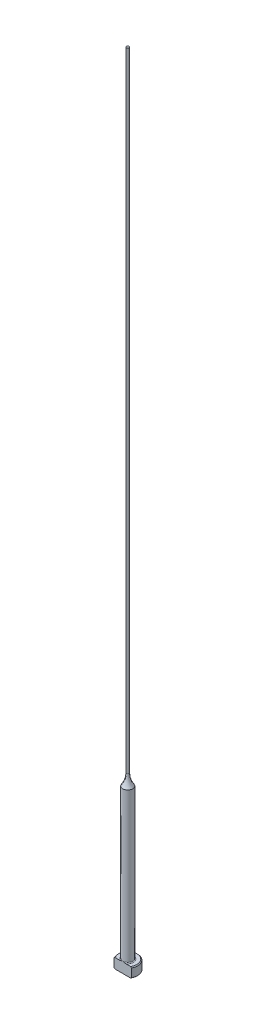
ISO-10303-21;
HEADER;
FILE_DESCRIPTION(('STEP AP214'),'2;1');
FILE_NAME('part.step','',(''),(''),'','','');
FILE_SCHEMA(('AUTOMOTIVE_DESIGN { 1 0 10303 214 1 1 1 1 }'));
ENDSEC;
DATA;
#1=APPLICATION_CONTEXT('core data for automotive mechanical design processes');
#2=APPLICATION_PROTOCOL_DEFINITION('international standard','automotive_design',2000,#1);
#3=PRODUCT_CONTEXT('',#1,'mechanical');
#4=PRODUCT('Part','Part','',(#3));
#5=PRODUCT_RELATED_PRODUCT_CATEGORY('part','',(#4));
#6=PRODUCT_DEFINITION_FORMATION('','',#4);
#7=PRODUCT_DEFINITION_CONTEXT('part definition',#1,'design');
#8=PRODUCT_DEFINITION('design','',#6,#7);
#9=PRODUCT_DEFINITION_SHAPE('','',#8);
#10=(LENGTH_UNIT() NAMED_UNIT(*) SI_UNIT(.MILLI.,.METRE.));
#11=(NAMED_UNIT(*) PLANE_ANGLE_UNIT() SI_UNIT($,.RADIAN.));
#12=(NAMED_UNIT(*) SI_UNIT($,.STERADIAN.) SOLID_ANGLE_UNIT());
#13=UNCERTAINTY_MEASURE_WITH_UNIT(LENGTH_MEASURE(1.E-05),#10,'distance_accuracy_value','');
#14=(GEOMETRIC_REPRESENTATION_CONTEXT(3) GLOBAL_UNCERTAINTY_ASSIGNED_CONTEXT((#13)) GLOBAL_UNIT_ASSIGNED_CONTEXT((#10,
#11,#12)) REPRESENTATION_CONTEXT('',''));
#15=CARTESIAN_POINT('',(0.,0.,0.));
#16=DIRECTION('',(0.,0.,1.));
#17=DIRECTION('',(1.,0.,0.));
#18=AXIS2_PLACEMENT_3D('',#15,#16,#17);
#19=CARTESIAN_POINT('',(-0.396239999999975,254.,0.));
#20=DIRECTION('',(0.,1.,0.));
#21=DIRECTION('',(0.,0.,1.));
#22=AXIS2_PLACEMENT_3D('',#19,#20,#21);
#23=PLANE('',#22);
#24=CARTESIAN_POINT('',(0.,254.,0.));
#25=DIRECTION('',(0.,1.,0.));
#26=DIRECTION('',(0.,0.,1.));
#27=AXIS2_PLACEMENT_3D('',#24,#25,#26);
#28=CIRCLE('',#27,0.396239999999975);
#29=CARTESIAN_POINT('',(0.,254.,0.396239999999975));
#30=VERTEX_POINT('',#29);
#31=EDGE_CURVE('E164',#30,#30,#28,.T.);
#32=ORIENTED_EDGE('',*,*,#31,.T.);
#33=EDGE_LOOP('',(#32));
#34=FACE_BOUND('',#33,.T.);
#35=ADVANCED_FACE('F32',(#34),#23,.T.);
#36=CARTESIAN_POINT('',(0.,259.958771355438,0.));
#37=DIRECTION('',(0.,1.,0.));
#38=DIRECTION('',(0.,0.,1.));
#39=AXIS2_PLACEMENT_3D('',#36,#37,#38);
#40=CYLINDRICAL_SURFACE('',#39,0.396239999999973);
#41=CARTESIAN_POINT('',(0.,54.5026884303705,0.));
#42=DIRECTION('',(0.,1.,0.));
#43=DIRECTION('',(0.,0.,1.));
#44=AXIS2_PLACEMENT_3D('',#41,#42,#43);
#45=CIRCLE('',#44,0.396239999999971);
#46=CARTESIAN_POINT('',(0.,54.5026884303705,0.396239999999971));
#47=VERTEX_POINT('',#46);
#48=EDGE_CURVE('E167',#47,#47,#45,.T.);
#49=ORIENTED_EDGE('',*,*,#48,.T.);
#50=EDGE_LOOP('',(#49));
#51=FACE_BOUND('',#50,.T.);
#52=ORIENTED_EDGE('',*,*,#31,.F.);
#53=EDGE_LOOP('',(#52));
#54=FACE_BOUND('',#53,.T.);
#55=ADVANCED_FACE('F155',(#51,#54),#40,.T.);
#56=CARTESIAN_POINT('',(0.,54.5026884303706,0.));
#57=DIRECTION('',(0.,1.,0.));
#58=DIRECTION('',(0.,0.,1.));
#59=AXIS2_PLACEMENT_3D('',#56,#57,#58);
#60=TOROIDAL_SURFACE('',#59,6.74623999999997,6.35);
#61=CARTESIAN_POINT('',(0.,50.8,0.));
#62=DIRECTION('',(0.,1.,0.));
#63=DIRECTION('',(0.,0.,1.));
#64=AXIS2_PLACEMENT_3D('',#61,#62,#63);
#65=CIRCLE('',#64,1.58749999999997);
#66=CARTESIAN_POINT('',(0.,50.8,1.58749999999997));
#67=VERTEX_POINT('',#66);
#68=EDGE_CURVE('E95',#67,#67,#65,.T.);
#69=ORIENTED_EDGE('',*,*,#68,.T.);
#70=EDGE_LOOP('',(#69));
#71=FACE_BOUND('',#70,.T.);
#72=ORIENTED_EDGE('',*,*,#48,.F.);
#73=EDGE_LOOP('',(#72));
#74=FACE_BOUND('',#73,.T.);
#75=ADVANCED_FACE('F160',(#71,#74),#60,.F.);
#76=CARTESIAN_POINT('',(0.,259.958771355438,0.));
#77=DIRECTION('',(0.,1.,0.));
#78=DIRECTION('',(0.,0.,1.));
#79=AXIS2_PLACEMENT_3D('',#76,#77,#78);
#80=CYLINDRICAL_SURFACE('',#79,1.58749999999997);
#81=CARTESIAN_POINT('',(0.,3.42900000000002,0.));
#82=DIRECTION('',(0.,1.,0.));
#83=DIRECTION('',(0.,0.,1.));
#84=AXIS2_PLACEMENT_3D('',#81,#82,#83);
#85=CIRCLE('',#84,1.58749999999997);
#86=CARTESIAN_POINT('',(0.,3.42900000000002,1.58749999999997));
#87=VERTEX_POINT('',#86);
#88=EDGE_CURVE('E104',#87,#87,#85,.T.);
#89=ORIENTED_EDGE('',*,*,#88,.T.);
#90=EDGE_LOOP('',(#89));
#91=FACE_BOUND('',#90,.T.);
#92=ORIENTED_EDGE('',*,*,#68,.F.);
#93=EDGE_LOOP('',(#92));
#94=FACE_BOUND('',#93,.T.);
#95=ADVANCED_FACE('F187',(#91,#94),#80,.T.);
#96=CARTESIAN_POINT('',(-3.17499999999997,3.175,0.));
#97=DIRECTION('',(0.,1.,0.));
#98=DIRECTION('',(0.,0.,1.));
#99=AXIS2_PLACEMENT_3D('',#96,#97,#98);
#100=PLANE('',#99);
#101=DIRECTION('',(-1.,0.,0.));
#102=VECTOR('',#101,1.);
#103=CARTESIAN_POINT('',(-3.17499999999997,3.175,1.58749999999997));
#104=LINE('',#103,#102);
#105=CARTESIAN_POINT('',(2.45195529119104,3.175,1.58749999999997));
#106=VERTEX_POINT('',#105);
#107=CARTESIAN_POINT('',(0.933255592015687,3.175,1.58749999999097));
#108=VERTEX_POINT('',#107);
#109=EDGE_CURVE('E53',#106,#108,#104,.T.);
#110=ORIENTED_EDGE('',*,*,#109,.F.);
#111=CARTESIAN_POINT('',(0.,3.175,0.));
#112=DIRECTION('',(0.,1.,0.));
#113=DIRECTION('',(0.,0.,1.));
#114=AXIS2_PLACEMENT_3D('',#111,#112,#113);
#115=CIRCLE('',#114,2.92099999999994);
#116=CARTESIAN_POINT('',(-2.45195529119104,3.175,1.58749999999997));
#117=VERTEX_POINT('',#116);
#118=EDGE_CURVE('E166',#106,#117,#115,.T.);
#119=ORIENTED_EDGE('',*,*,#118,.T.);
#120=CARTESIAN_POINT('',(-0.933255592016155,3.17500000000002,1.58749999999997));
#121=VERTEX_POINT('',#120);
#122=EDGE_CURVE('E135',#121,#117,#104,.T.);
#123=ORIENTED_EDGE('',*,*,#122,.F.);
#124=CARTESIAN_POINT('',(0.,3.175,0.));
#125=DIRECTION('',(0.,1.,0.));
#126=DIRECTION('',(0.,0.,1.));
#127=AXIS2_PLACEMENT_3D('',#124,#125,#126);
#128=CIRCLE('',#127,1.84149999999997);
#129=EDGE_CURVE('E108',#121,#108,#128,.F.);
#130=ORIENTED_EDGE('',*,*,#129,.T.);
#131=EDGE_LOOP('',(#110,#119,#123,#130));
#132=FACE_BOUND('',#131,.T.);
#133=ADVANCED_FACE('F184',(#132),#100,.T.);
#134=CARTESIAN_POINT('',(0.,259.958771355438,0.));
#135=DIRECTION('',(0.,1.,0.));
#136=DIRECTION('',(0.,0.,1.));
#137=AXIS2_PLACEMENT_3D('',#134,#135,#136);
#138=CYLINDRICAL_SURFACE('',#137,3.17499999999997);
#139=DIRECTION('',(0.,-1.,0.));
#140=VECTOR('',#139,1.);
#141=CARTESIAN_POINT('',(-2.74963065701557,254.,1.58749999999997));
#142=LINE('',#141,#140);
#143=CARTESIAN_POINT('',(-2.74963065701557,2.92100000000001,1.58749999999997));
#144=VERTEX_POINT('',#143);
#145=CARTESIAN_POINT('',(-2.74963065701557,0.253999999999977,1.58749999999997));
#146=VERTEX_POINT('',#145);
#147=EDGE_CURVE('E90',#144,#146,#142,.T.);
#148=ORIENTED_EDGE('',*,*,#147,.F.);
#149=CARTESIAN_POINT('',(0.,2.92100000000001,0.));
#150=DIRECTION('',(0.,1.,0.));
#151=DIRECTION('',(0.,0.,1.));
#152=AXIS2_PLACEMENT_3D('',#149,#150,#151);
#153=CIRCLE('',#152,3.17499999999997);
#154=CARTESIAN_POINT('',(2.74963065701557,2.92100000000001,1.58749999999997));
#155=VERTEX_POINT('',#154);
#156=EDGE_CURVE('E105',#144,#155,#153,.F.);
#157=ORIENTED_EDGE('',*,*,#156,.T.);
#158=DIRECTION('',(0.,-1.,0.));
#159=VECTOR('',#158,1.);
#160=CARTESIAN_POINT('',(2.74963065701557,254.,1.58749999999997));
#161=LINE('',#160,#159);
#162=CARTESIAN_POINT('',(2.74963065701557,0.253999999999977,1.58749999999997));
#163=VERTEX_POINT('',#162);
#164=EDGE_CURVE('E177',#155,#163,#161,.T.);
#165=ORIENTED_EDGE('',*,*,#164,.T.);
#166=CARTESIAN_POINT('',(0.,0.253999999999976,0.));
#167=DIRECTION('',(0.,-1.,0.));
#168=DIRECTION('',(0.,0.,-1.));
#169=AXIS2_PLACEMENT_3D('',#166,#167,#168);
#170=CIRCLE('',#169,3.17499999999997);
#171=EDGE_CURVE('E111',#163,#146,#170,.F.);
#172=ORIENTED_EDGE('',*,*,#171,.T.);
#173=EDGE_LOOP('',(#148,#157,#165,#172));
#174=FACE_BOUND('',#173,.T.);
#175=ADVANCED_FACE('F175',(#174),#138,.T.);
#176=CARTESIAN_POINT('',(0.,0.,0.));
#177=DIRECTION('',(0.,-1.,0.));
#178=DIRECTION('',(0.,0.,-1.));
#179=AXIS2_PLACEMENT_3D('',#176,#177,#178);
#180=PLANE('',#179);
#181=DIRECTION('',(1.,0.,0.));
#182=VECTOR('',#181,1.);
#183=CARTESIAN_POINT('',(-2.74963065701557,0.,1.58749999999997));
#184=LINE('',#183,#182);
#185=CARTESIAN_POINT('',(-2.45195529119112,0.,1.58749999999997));
#186=VERTEX_POINT('',#185);
#187=CARTESIAN_POINT('',(2.45195529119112,0.,1.58749999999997));
#188=VERTEX_POINT('',#187);
#189=EDGE_CURVE('E87',#186,#188,#184,.T.);
#190=ORIENTED_EDGE('',*,*,#189,.F.);
#191=CARTESIAN_POINT('',(0.,0.,0.));
#192=DIRECTION('',(0.,-1.,0.));
#193=DIRECTION('',(0.,0.,-1.));
#194=AXIS2_PLACEMENT_3D('',#191,#192,#193);
#195=CIRCLE('',#194,2.92100000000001);
#196=EDGE_CURVE('E101',#186,#188,#195,.T.);
#197=ORIENTED_EDGE('',*,*,#196,.T.);
#198=EDGE_LOOP('',(#190,#197));
#199=FACE_BOUND('',#198,.T.);
#200=ADVANCED_FACE('F100',(#199),#180,.T.);
#201=CARTESIAN_POINT('',(0.,3.17499999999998,0.));
#202=DIRECTION('',(0.,-1.,0.));
#203=DIRECTION('',(0.,0.,-1.));
#204=AXIS2_PLACEMENT_3D('',#201,#202,#203);
#205=CONICAL_SURFACE('',#204,2.92099999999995,0.785398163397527);
#206=CARTESIAN_POINT('',(6.0529050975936,-0.16162066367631,1.58749999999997));
#207=CARTESIAN_POINT('',(5.91567682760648,-0.0288893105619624,1.58749999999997));
#208=CARTESIAN_POINT('',(5.7783103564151,0.103699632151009,1.58749999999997));
#209=CARTESIAN_POINT('',(5.50321874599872,0.368508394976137,1.58749999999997));
#210=CARTESIAN_POINT('',(5.36549360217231,0.500728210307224,1.58749999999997));
#211=CARTESIAN_POINT('',(5.08953516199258,0.764778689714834,1.58749999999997));
#212=CARTESIAN_POINT('',(4.9513016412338,0.896609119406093,1.58749999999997));
#213=CARTESIAN_POINT('',(4.67428233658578,1.15968706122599,1.58749999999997));
#214=CARTESIAN_POINT('',(4.53549655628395,1.29093457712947,1.58749999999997));
#215=CARTESIAN_POINT('',(4.25997724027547,1.55007705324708,1.58749999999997));
#216=CARTESIAN_POINT('',(4.12325766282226,1.67798684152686,1.58749999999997));
#217=CARTESIAN_POINT('',(3.84892898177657,1.9328486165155,1.58749999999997));
#218=CARTESIAN_POINT('',(3.71131988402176,2.05980060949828,1.58749999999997));
#219=CARTESIAN_POINT('',(3.43493978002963,2.31237508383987,1.58749999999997));
#220=CARTESIAN_POINT('',(3.29616903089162,2.43799784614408,1.58749999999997));
#221=CARTESIAN_POINT('',(3.01699558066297,2.68741369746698,1.58749999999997));
#222=CARTESIAN_POINT('',(2.8765929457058,2.81120686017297,1.58749999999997));
#223=CARTESIAN_POINT('',(2.64816703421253,3.00875865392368,1.58749999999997));
#224=CARTESIAN_POINT('',(2.56087478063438,3.08336151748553,1.58749999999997));
#225=CARTESIAN_POINT('',(2.38515423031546,3.23123871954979,1.58749999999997));
#226=CARTESIAN_POINT('',(2.29672582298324,3.30451292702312,1.58749999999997));
#227=CARTESIAN_POINT('',(2.11747400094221,3.45004422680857,1.58749999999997));
#228=CARTESIAN_POINT('',(2.02663514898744,3.5222823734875,1.58749999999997));
#229=CARTESIAN_POINT('',(1.8430252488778,3.66423097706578,1.58749999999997));
#230=CARTESIAN_POINT('',(1.75025467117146,3.73394203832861,1.58749999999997));
#231=CARTESIAN_POINT('',(1.56067475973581,3.87080633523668,1.58749999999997));
#232=CARTESIAN_POINT('',(1.46382547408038,3.93790459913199,1.58749999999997));
#233=CARTESIAN_POINT('',(1.26632594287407,4.06669147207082,1.58749999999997));
#234=CARTESIAN_POINT('',(1.16567073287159,4.1283726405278,1.58749999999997));
#235=CARTESIAN_POINT('',(1.01165766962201,4.21402252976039,1.58749999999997));
#236=CARTESIAN_POINT('',(0.960142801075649,4.24127929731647,1.58749999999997));
#237=CARTESIAN_POINT('',(0.855780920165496,4.2930979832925,1.58749999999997));
#238=CARTESIAN_POINT('',(0.80293366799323,4.31765941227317,1.58749999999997));
#239=CARTESIAN_POINT('',(0.642461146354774,4.38614656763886,1.58749999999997));
#240=CARTESIAN_POINT('',(0.532518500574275,4.42510149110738,1.58749999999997));
#241=CARTESIAN_POINT('',(0.367680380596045,4.46726244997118,1.58749999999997));
#242=CARTESIAN_POINT('',(0.31480288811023,4.47844427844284,1.58749999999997));
#243=CARTESIAN_POINT('',(0.208209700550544,4.49576654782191,1.58749999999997));
#244=CARTESIAN_POINT('',(0.154494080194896,4.50190743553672,1.58749999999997));
#245=CARTESIAN_POINT('',(0.0468792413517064,4.50871296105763,1.58749999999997));
#246=CARTESIAN_POINT('',(-0.0070188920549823,4.5093945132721,1.58749999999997));
#247=CARTESIAN_POINT('',(-0.114606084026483,4.50527679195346,1.58749999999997));
#248=CARTESIAN_POINT('',(-0.168295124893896,4.50047706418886,1.58749999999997));
#249=CARTESIAN_POINT('',(-0.274485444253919,4.48579689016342,1.58749999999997));
#250=CARTESIAN_POINT('',(-0.326992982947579,4.47596081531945,1.58749999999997));
#251=CARTESIAN_POINT('',(-0.430974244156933,4.45181809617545,1.58749999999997));
#252=CARTESIAN_POINT('',(-0.482447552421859,4.4375096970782,1.58749999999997));
#253=CARTESIAN_POINT('',(-0.584460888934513,4.40502489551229,1.58749999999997));
#254=CARTESIAN_POINT('',(-0.634994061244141,4.386827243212,1.58749999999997));
#255=CARTESIAN_POINT('',(-0.734789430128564,4.34729308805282,1.58749999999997));
#256=CARTESIAN_POINT('',(-0.784051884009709,4.3259572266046,1.58749999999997));
#257=CARTESIAN_POINT('',(-0.930549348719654,4.25791922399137,1.58749999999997));
#258=CARTESIAN_POINT('',(-1.0259880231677,4.20736047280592,1.58749999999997));
#259=CARTESIAN_POINT('',(-1.21304313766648,4.0995545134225,1.58749999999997));
#260=CARTESIAN_POINT('',(-1.30465471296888,4.04229912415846,1.58749999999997));
#261=CARTESIAN_POINT('',(-1.48526211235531,3.92308746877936,1.58749999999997));
#262=CARTESIAN_POINT('',(-1.57424615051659,3.86111349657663,1.58749999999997));
#263=CARTESIAN_POINT('',(-1.74990003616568,3.73408621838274,1.58749999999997));
#264=CARTESIAN_POINT('',(-1.83657099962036,3.66903444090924,1.58749999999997));
#265=CARTESIAN_POINT('',(-2.00931764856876,3.53583371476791,1.58749999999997));
#266=CARTESIAN_POINT('',(-2.09537048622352,3.46765527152,1.58749999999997));
#267=CARTESIAN_POINT('',(-2.26611736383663,3.32960643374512,1.58749999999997));
#268=CARTESIAN_POINT('',(-2.35081125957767,3.25973586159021,1.58749999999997));
#269=CARTESIAN_POINT('',(-2.60290121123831,3.04858139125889,1.58749999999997));
#270=CARTESIAN_POINT('',(-2.76872537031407,2.90542388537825,1.58749999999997));
#271=CARTESIAN_POINT('',(-3.06970913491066,2.64069522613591,1.58749999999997));
#272=CARTESIAN_POINT('',(-3.20528660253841,2.51959458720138,1.58749999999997));
#273=CARTESIAN_POINT('',(-3.47510321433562,2.27590400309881,1.58749999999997));
#274=CARTESIAN_POINT('',(-3.60934232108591,2.1533140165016,1.58749999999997));
#275=CARTESIAN_POINT('',(-3.87695374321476,1.90694239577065,1.58749999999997));
#276=CARTESIAN_POINT('',(-4.0103251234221,1.78315974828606,1.58749999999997));
#277=CARTESIAN_POINT('',(-4.27630880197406,1.53478104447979,1.58749999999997));
#278=CARTESIAN_POINT('',(-4.40892109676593,1.41018498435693,1.58749999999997));
#279=CARTESIAN_POINT('',(-4.79499418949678,1.0457468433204,1.58749999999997));
#280=CARTESIAN_POINT('',(-5.04767313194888,0.805076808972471,1.58749999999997));
#281=CARTESIAN_POINT('',(-5.42550911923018,0.443121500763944,1.58749999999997));
#282=CARTESIAN_POINT('',(-5.55118772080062,0.322378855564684,1.58749999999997));
#283=CARTESIAN_POINT('',(-5.80225207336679,0.0805914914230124,1.58749999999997));
#284=CARTESIAN_POINT('',(-5.92763782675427,-0.0404532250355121,1.58749999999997));
#285=CARTESIAN_POINT('',(-6.0529050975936,-0.161620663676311,1.58749999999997));
#286=B_SPLINE_CURVE_WITH_KNOTS('',3,(#206,#207,#208,#209,#210,#211,#212,#213,#214,#215,#216,
#217,#218,#219,#220,#221,#222,#223,#224,#225,#226,#227,#228,#229,#230,#231,#232,#233,#234,#235,
#236,#237,#238,#239,#240,#241,#242,#243,#244,#245,#246,#247,#248,#249,#250,#251,#252,#253,#254,
#255,#256,#257,#258,#259,#260,#261,#262,#263,#264,#265,#266,#267,#268,#269,#270,#271,#272,#273,
#274,#275,#276,#277,#278,#279,#280,#281,#282,#283,#284,#285),.UNSPECIFIED.,.F.,.F.,(4,2,2,2,2,2,
2,2,2,2,2,2,2,2,2,2,2,2,2,2,2,2,2,2,2,2,2,2,2,2,2,2,2,2,2,2,2,2,2,4),(0.,0.572750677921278,
1.14550874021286,1.71856057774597,2.29160869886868,2.85328006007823,3.4149477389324,
3.97649423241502,4.53801804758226,4.88249307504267,5.22700189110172,5.5751532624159,
5.92322081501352,6.27657800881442,6.63041319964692,6.80518126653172,6.9799810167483,
7.3282426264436,7.49018491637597,7.65211285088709,7.81353889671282,7.97497832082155,
8.13501929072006,8.29512313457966,8.45612518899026,8.61709438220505,8.94062993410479,
9.2645649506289,9.58978187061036,9.91483894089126,10.2441741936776,10.5735441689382,
11.2306812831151,11.7760337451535,12.3214014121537,12.8672825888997,13.4131663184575,
14.4600164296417,14.9828595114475,15.5056983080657),.UNSPECIFIED.);
#287=EDGE_CURVE('E58',#155,#106,#286,.T.);
#288=ORIENTED_EDGE('',*,*,#287,.F.);
#289=ORIENTED_EDGE('',*,*,#156,.F.);
#290=EDGE_CURVE('E128',#117,#144,#286,.T.);
#291=ORIENTED_EDGE('',*,*,#290,.F.);
#292=ORIENTED_EDGE('',*,*,#118,.F.);
#293=EDGE_LOOP('',(#288,#289,#291,#292));
#294=FACE_BOUND('',#293,.T.);
#295=ADVANCED_FACE('F142',(#294),#205,.T.);
#296=CARTESIAN_POINT('',(0.,0.253999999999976,0.));
#297=DIRECTION('',(0.,1.,0.));
#298=DIRECTION('',(0.,0.,1.));
#299=AXIS2_PLACEMENT_3D('',#296,#297,#298);
#300=CONICAL_SURFACE('',#299,3.17499999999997,0.785398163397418);
#301=CARTESIAN_POINT('',(-6.0529050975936,3.33662066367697,1.58749999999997));
#302=CARTESIAN_POINT('',(-5.91567682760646,3.20388931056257,1.58749999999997));
#303=CARTESIAN_POINT('',(-5.77831035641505,3.07130036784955,1.58749999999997));
#304=CARTESIAN_POINT('',(-5.50321874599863,2.80649160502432,1.58749999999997));
#305=CARTESIAN_POINT('',(-5.3654936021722,2.67427178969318,1.58749999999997));
#306=CARTESIAN_POINT('',(-5.08953516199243,2.41022131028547,1.58749999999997));
#307=CARTESIAN_POINT('',(-4.95130164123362,2.27839088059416,1.58749999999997));
#308=CARTESIAN_POINT('',(-4.67428233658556,2.01531293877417,1.58749999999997));
#309=CARTESIAN_POINT('',(-4.5354965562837,1.88406542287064,1.58749999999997));
#310=CARTESIAN_POINT('',(-4.25997724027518,1.62492294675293,1.58749999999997));
#311=CARTESIAN_POINT('',(-4.12325766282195,1.49701315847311,1.58749999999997));
#312=CARTESIAN_POINT('',(-3.84892898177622,1.24215138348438,1.58749999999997));
#313=CARTESIAN_POINT('',(-3.71131988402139,1.11519939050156,1.58749999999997));
#314=CARTESIAN_POINT('',(-3.43493978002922,0.862624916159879,1.58749999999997));
#315=CARTESIAN_POINT('',(-3.29616903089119,0.737002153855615,1.58749999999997));
#316=CARTESIAN_POINT('',(-3.01699558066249,0.487586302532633,1.58749999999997));
#317=CARTESIAN_POINT('',(-2.8765929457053,0.363793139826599,1.58749999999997));
#318=CARTESIAN_POINT('',(-2.64816703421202,0.166241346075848,1.58749999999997));
#319=CARTESIAN_POINT('',(-2.56087478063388,0.0916384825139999,1.58749999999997));
#320=CARTESIAN_POINT('',(-2.385154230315,-0.0562387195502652,1.58749999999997));
#321=CARTESIAN_POINT('',(-2.29672582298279,-0.129512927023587,1.58749999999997));
#322=CARTESIAN_POINT('',(-2.11747400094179,-0.275044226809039,1.58749999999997));
#323=CARTESIAN_POINT('',(-2.02663514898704,-0.347282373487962,1.58749999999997));
#324=CARTESIAN_POINT('',(-1.84302524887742,-0.489230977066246,1.58749999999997));
#325=CARTESIAN_POINT('',(-1.7502546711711,-0.558942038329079,1.58749999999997));
#326=CARTESIAN_POINT('',(-1.56067475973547,-0.695806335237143,1.58749999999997));
#327=CARTESIAN_POINT('',(-1.46382547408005,-0.762904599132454,1.58749999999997));
#328=CARTESIAN_POINT('',(-1.26632594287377,-0.891691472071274,1.58749999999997));
#329=CARTESIAN_POINT('',(-1.16567073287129,-0.953372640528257,1.58749999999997));
#330=CARTESIAN_POINT('',(-1.01165766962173,-1.03902252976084,1.58749999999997));
#331=CARTESIAN_POINT('',(-0.960142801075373,-1.06627929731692,1.58749999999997));
#332=CARTESIAN_POINT('',(-0.85578092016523,-1.11809798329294,1.58749999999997));
#333=CARTESIAN_POINT('',(-0.802933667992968,-1.14265941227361,1.58749999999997));
#334=CARTESIAN_POINT('',(-0.642461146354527,-1.21114656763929,1.58749999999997));
#335=CARTESIAN_POINT('',(-0.532518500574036,-1.2501014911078,1.58749999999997));
#336=CARTESIAN_POINT('',(-0.367680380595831,-1.29226244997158,1.58749999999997));
#337=CARTESIAN_POINT('',(-0.314802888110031,-1.30344427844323,1.58749999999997));
#338=CARTESIAN_POINT('',(-0.208209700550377,-1.32076654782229,1.58749999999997));
#339=CARTESIAN_POINT('',(-0.154494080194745,-1.3269074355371,1.58749999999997));
#340=CARTESIAN_POINT('',(-0.0468792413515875,-1.333712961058,1.58749999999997));
#341=CARTESIAN_POINT('',(0.00701889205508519,-1.33439451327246,1.58749999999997));
#342=CARTESIAN_POINT('',(0.114606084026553,-1.33027679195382,1.58749999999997));
#343=CARTESIAN_POINT('',(0.16829512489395,-1.32547706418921,1.58749999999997));
#344=CARTESIAN_POINT('',(0.274485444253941,-1.31079689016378,1.58749999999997));
#345=CARTESIAN_POINT('',(0.326992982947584,-1.3009608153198,1.58749999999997));
#346=CARTESIAN_POINT('',(0.430974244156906,-1.27681809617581,1.58749999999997));
#347=CARTESIAN_POINT('',(0.482447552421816,-1.26250969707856,1.58749999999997));
#348=CARTESIAN_POINT('',(0.584460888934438,-1.23002489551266,1.58749999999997));
#349=CARTESIAN_POINT('',(0.634994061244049,-1.21182724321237,1.58749999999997));
#350=CARTESIAN_POINT('',(0.734789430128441,-1.1722930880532,1.58749999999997));
#351=CARTESIAN_POINT('',(0.784051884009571,-1.15095722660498,1.58749999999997));
#352=CARTESIAN_POINT('',(0.93054934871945,-1.08291922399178,1.58749999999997));
#353=CARTESIAN_POINT('',(1.02598802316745,-1.03236047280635,1.58749999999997));
#354=CARTESIAN_POINT('',(1.21304313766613,-0.924554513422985,1.58749999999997));
#355=CARTESIAN_POINT('',(1.30465471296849,-0.86729912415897,1.58749999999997));
#356=CARTESIAN_POINT('',(1.48526211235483,-0.748087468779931,1.58749999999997));
#357=CARTESIAN_POINT('',(1.57424615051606,-0.686113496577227,1.58749999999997));
#358=CARTESIAN_POINT('',(1.74990003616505,-0.559086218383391,1.58749999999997));
#359=CARTESIAN_POINT('',(1.83657099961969,-0.494034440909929,1.58749999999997));
#360=CARTESIAN_POINT('',(2.009317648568,-0.360833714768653,1.58749999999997));
#361=CARTESIAN_POINT('',(2.09537048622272,-0.292655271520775,1.58749999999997));
#362=CARTESIAN_POINT('',(2.26611736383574,-0.154606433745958,1.58749999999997));
#363=CARTESIAN_POINT('',(2.35081125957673,-0.0847358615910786,1.58749999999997));
#364=CARTESIAN_POINT('',(2.60290121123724,0.126418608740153,1.58749999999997));
#365=CARTESIAN_POINT('',(2.7687253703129,0.269576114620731,1.58749999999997));
#366=CARTESIAN_POINT('',(3.06970913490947,0.534304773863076,1.58749999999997));
#367=CARTESIAN_POINT('',(3.20528660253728,0.65540541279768,1.58749999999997));
#368=CARTESIAN_POINT('',(3.47510321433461,0.899095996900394,1.58749999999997));
#369=CARTESIAN_POINT('',(3.60934232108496,1.02168598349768,1.58749999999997));
#370=CARTESIAN_POINT('',(3.87695374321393,1.26805760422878,1.58749999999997));
#371=CARTESIAN_POINT('',(4.01032512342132,1.39184025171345,1.58749999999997));
#372=CARTESIAN_POINT('',(4.2763088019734,1.64021895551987,1.58749999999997));
#373=CARTESIAN_POINT('',(4.40892109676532,1.76481501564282,1.58749999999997));
#374=CARTESIAN_POINT('',(4.79499418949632,2.12925315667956,1.58749999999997));
#375=CARTESIAN_POINT('',(5.04767313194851,2.36992319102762,1.58749999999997));
#376=CARTESIAN_POINT('',(5.42550911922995,2.73187849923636,1.58749999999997));
#377=CARTESIAN_POINT('',(5.55118772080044,2.85262114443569,1.58749999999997));
#378=CARTESIAN_POINT('',(5.8022520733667,3.0944085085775,1.58749999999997));
#379=CARTESIAN_POINT('',(5.92763782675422,3.2154532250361,1.58749999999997));
#380=CARTESIAN_POINT('',(6.0529050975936,3.33662066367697,1.58749999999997));
#381=B_SPLINE_CURVE_WITH_KNOTS('',3,(#301,#302,#303,#304,#305,#306,#307,#308,#309,#310,#311,
#312,#313,#314,#315,#316,#317,#318,#319,#320,#321,#322,#323,#324,#325,#326,#327,#328,#329,#330,
#331,#332,#333,#334,#335,#336,#337,#338,#339,#340,#341,#342,#343,#344,#345,#346,#347,#348,#349,
#350,#351,#352,#353,#354,#355,#356,#357,#358,#359,#360,#361,#362,#363,#364,#365,#366,#367,#368,
#369,#370,#371,#372,#373,#374,#375,#376,#377,#378,#379,#380),.UNSPECIFIED.,.F.,.F.,(4,2,2,2,2,2,
2,2,2,2,2,2,2,2,2,2,2,2,2,2,2,2,2,2,2,2,2,2,2,2,2,2,2,2,2,2,2,2,2,4),(0.,0.57275067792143,
1.14550874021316,1.71856057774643,2.29160869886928,2.85328006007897,3.41494773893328,
3.97649423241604,4.53801804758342,4.88249307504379,5.2270018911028,5.57515326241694,
5.92322081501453,6.27657800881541,6.63041319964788,6.80518126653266,6.97998101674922,
7.32824262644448,7.49018491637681,7.65211285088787,7.81353889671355,7.97497832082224,
8.1350192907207,8.29512313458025,8.4561251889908,8.61709438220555,8.94062993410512,
9.26456495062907,9.58978187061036,9.91483894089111,10.2441741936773,10.5735441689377,
11.2306812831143,11.7760337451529,12.3214014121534,12.8672825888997,13.4131663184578,
14.4600164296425,14.9828595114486,15.505698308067),.UNSPECIFIED.);
#382=EDGE_CURVE('E84',#146,#186,#381,.T.);
#383=ORIENTED_EDGE('',*,*,#382,.F.);
#384=ORIENTED_EDGE('',*,*,#171,.F.);
#385=EDGE_CURVE('E96',#188,#163,#381,.T.);
#386=ORIENTED_EDGE('',*,*,#385,.F.);
#387=ORIENTED_EDGE('',*,*,#196,.F.);
#388=EDGE_LOOP('',(#383,#384,#386,#387));
#389=FACE_BOUND('',#388,.T.);
#390=ADVANCED_FACE('F103',(#389),#300,.T.);
#391=CARTESIAN_POINT('',(0.,3.42900000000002,0.));
#392=DIRECTION('',(0.,1.,0.));
#393=DIRECTION('',(0.,0.,1.));
#394=AXIS2_PLACEMENT_3D('',#391,#392,#393);
#395=TOROIDAL_SURFACE('',#394,1.84149999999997,0.254);
#396=ORIENTED_EDGE('',*,*,#129,.F.);
#397=CARTESIAN_POINT('',(0.,3.42900000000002,1.58749999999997));
#398=CARTESIAN_POINT('',(-1.9220503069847E-10,3.42900057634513,1.58749999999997));
#399=CARTESIAN_POINT('',(-1.22611612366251E-07,3.42900115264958,1.58749999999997));
#400=CARTESIAN_POINT('',(-5.09676358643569E-07,3.42900226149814,1.58749999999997));
#401=CARTESIAN_POINT('',(-7.78176319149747E-07,3.42900279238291,1.58749999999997));
#402=CARTESIAN_POINT('',(-1.42307271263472E-06,3.42900385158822,1.58749999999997));
#403=CARTESIAN_POINT('',(-1.80713865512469E-06,3.42900437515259,1.58749999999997));
#404=CARTESIAN_POINT('',(-2.63494844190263E-06,3.42900536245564,1.58749999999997));
#405=CARTESIAN_POINT('',(-3.07814754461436E-06,3.42900582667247,1.58749999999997));
#406=CARTESIAN_POINT('',(-4.66897354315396E-06,3.42900738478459,1.58749999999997));
#407=CARTESIAN_POINT('',(-5.8940490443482E-06,3.42900840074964,1.58749999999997));
#408=CARTESIAN_POINT('',(-8.42427506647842E-06,3.42901020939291,1.58749999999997));
#409=CARTESIAN_POINT('',(-9.72480570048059E-06,3.42901100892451,1.58749999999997));
#410=CARTESIAN_POINT('',(-1.48060601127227E-05,3.42901401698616,1.58749999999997));
#411=CARTESIAN_POINT('',(-1.86838280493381E-05,3.42901606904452,1.58749999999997));
#412=CARTESIAN_POINT('',(-2.63261116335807E-05,3.42901942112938,1.58749999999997));
#413=CARTESIAN_POINT('',(-3.00687416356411E-05,3.42902077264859,1.58749999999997));
#414=CARTESIAN_POINT('',(-4.60276297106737E-05,3.42902652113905,1.58749999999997));
#415=CARTESIAN_POINT('',(-5.82470196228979E-05,3.4290308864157,1.58749999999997));
#416=CARTESIAN_POINT('',(-8.11070094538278E-05,3.42903788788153,1.58749999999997));
#417=CARTESIAN_POINT('',(-9.16953111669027E-05,3.42904068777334,1.58749999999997));
#418=CARTESIAN_POINT('',(-0.000168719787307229,3.42906287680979,1.58749999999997));
#419=CARTESIAN_POINT('',(-0.000232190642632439,3.42909118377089,1.58749999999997));
#420=CARTESIAN_POINT('',(-0.000479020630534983,3.42919723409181,1.58749999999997));
#421=CARTESIAN_POINT('',(-0.000664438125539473,3.42926834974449,1.58749999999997));
#422=CARTESIAN_POINT('',(-0.00138448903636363,3.42954862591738,1.58749999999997));
#423=CARTESIAN_POINT('',(-0.00191701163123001,3.42976473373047,1.58749999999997));
#424=CARTESIAN_POINT('',(-0.00409774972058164,3.43064550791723,1.58749999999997));
#425=CARTESIAN_POINT('',(-0.00574830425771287,3.43130231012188,1.58749999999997));
#426=CARTESIAN_POINT('',(-0.028998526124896,3.44055947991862,1.58749999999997));
#427=CARTESIAN_POINT('',(-0.050581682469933,3.44921674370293,1.58749999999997));
#428=CARTESIAN_POINT('',(-0.0929947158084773,3.46610702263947,1.58749999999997));
#429=CARTESIAN_POINT('',(-0.113823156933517,3.4743439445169,1.58749999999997));
#430=CARTESIAN_POINT('',(-0.157956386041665,3.49164606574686,1.58749999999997));
#431=CARTESIAN_POINT('',(-0.181267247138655,3.50069608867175,1.58749999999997));
#432=CARTESIAN_POINT('',(-0.228222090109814,3.51863224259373,1.58749999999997));
#433=CARTESIAN_POINT('',(-0.25186705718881,3.52751579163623,1.58749999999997));
#434=CARTESIAN_POINT('',(-0.310512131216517,3.54905503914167,1.58749999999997));
#435=CARTESIAN_POINT('',(-0.345588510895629,3.56150550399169,1.58749999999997));
#436=CARTESIAN_POINT('',(-0.415278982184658,3.58503024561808,1.58749999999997));
#437=CARTESIAN_POINT('',(-0.449884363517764,3.59613012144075,1.58749999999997));
#438=CARTESIAN_POINT('',(-0.52447121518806,3.61841679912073,1.58749999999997));
#439=CARTESIAN_POINT('',(-0.564517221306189,3.62939137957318,1.58749999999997));
#440=CARTESIAN_POINT('',(-0.645529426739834,3.6489746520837,1.58749999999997));
#441=CARTESIAN_POINT('',(-0.686500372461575,3.65756417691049,1.58749999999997));
#442=CARTESIAN_POINT('',(-0.771546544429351,3.67188287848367,1.58749999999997));
#443=CARTESIAN_POINT('',(-0.815658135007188,3.67740449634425,1.58749999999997));
#444=CARTESIAN_POINT('',(-0.904117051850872,3.68344603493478,1.58749999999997));
#445=CARTESIAN_POINT('',(-0.948462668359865,3.68398638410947,1.58749999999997));
#446=CARTESIAN_POINT('',(-1.02531896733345,3.67901051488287,1.58749999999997));
#447=CARTESIAN_POINT('',(-1.05792141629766,3.67502604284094,1.58749999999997));
#448=CARTESIAN_POINT('',(-1.12184393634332,3.6623083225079,1.58749999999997));
#449=CARTESIAN_POINT('',(-1.15317534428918,3.65363950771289,1.58749999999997));
#450=CARTESIAN_POINT('',(-1.19946468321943,3.63563847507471,1.58749999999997));
#451=CARTESIAN_POINT('',(-1.2152678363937,3.62848492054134,1.58749999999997));
#452=CARTESIAN_POINT('',(-1.24583726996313,3.61212937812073,1.58749999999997));
#453=CARTESIAN_POINT('',(-1.26060215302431,3.60292469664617,1.58749999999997));
#454=CARTESIAN_POINT('',(-1.28575815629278,3.58421518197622,1.58749999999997));
#455=CARTESIAN_POINT('',(-1.29644383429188,3.57510998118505,1.58749999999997));
#456=CARTESIAN_POINT('',(-1.31623154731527,3.55531539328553,1.58749999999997));
#457=CARTESIAN_POINT('',(-1.32533681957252,3.54462932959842,1.58749999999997));
#458=CARTESIAN_POINT('',(-1.33941140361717,3.52450022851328,1.58749999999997));
#459=CARTESIAN_POINT('',(-1.34484814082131,3.51538553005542,1.58749999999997));
#460=CARTESIAN_POINT('',(-1.35416329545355,3.49638544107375,1.58749999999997));
#461=CARTESIAN_POINT('',(-1.35804267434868,3.48650053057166,1.58749999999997));
#462=CARTESIAN_POINT('',(-1.36398436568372,3.46611321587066,1.58749999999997));
#463=CARTESIAN_POINT('',(-1.36603350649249,3.45560690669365,1.58749999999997));
#464=CARTESIAN_POINT('',(-1.3680840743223,3.43439627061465,1.58749999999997));
#465=CARTESIAN_POINT('',(-1.36808648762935,3.42369204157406,1.58749999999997));
#466=CARTESIAN_POINT('',(-1.36616208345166,3.40366716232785,1.58749999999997));
#467=CARTESIAN_POINT('',(-1.36444960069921,3.39432493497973,1.58749999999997));
#468=CARTESIAN_POINT('',(-1.35953338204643,3.37604480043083,1.58749999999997));
#469=CARTESIAN_POINT('',(-1.3563294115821,3.36710695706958,1.58749999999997));
#470=CARTESIAN_POINT('',(-1.34848006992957,3.34949697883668,1.58749999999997));
#471=CARTESIAN_POINT('',(-1.34378578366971,3.34084688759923,1.58749999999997));
#472=CARTESIAN_POINT('',(-1.33324445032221,3.32428742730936,1.58749999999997));
#473=CARTESIAN_POINT('',(-1.32739692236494,3.3163783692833,1.58749999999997));
#474=CARTESIAN_POINT('',(-1.3110730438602,3.29692878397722,1.58749999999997));
#475=CARTESIAN_POINT('',(-1.29989286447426,3.28597778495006,1.58749999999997));
#476=CARTESIAN_POINT('',(-1.27593566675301,3.26597490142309,1.58749999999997));
#477=CARTESIAN_POINT('',(-1.26315370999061,3.25692913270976,1.58749999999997));
#478=CARTESIAN_POINT('',(-1.2293073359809,3.23613976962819,1.58749999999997));
#479=CARTESIAN_POINT('',(-1.20751096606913,3.225594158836,1.58749999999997));
#480=CARTESIAN_POINT('',(-1.16266144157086,3.20795356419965,1.58749999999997));
#481=CARTESIAN_POINT('',(-1.13960937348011,3.20085564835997,1.58749999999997));
#482=CARTESIAN_POINT('',(-1.07603916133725,3.18534571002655,1.58749999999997));
#483=CARTESIAN_POINT('',(-1.03486686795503,3.17965078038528,1.58749999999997));
#484=CARTESIAN_POINT('',(-0.951558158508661,3.1741711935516,1.58749999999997));
#485=CARTESIAN_POINT('',(-0.909417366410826,3.17449023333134,1.58749999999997));
#486=CARTESIAN_POINT('',(-0.811383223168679,3.18054602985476,1.58749999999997));
#487=CARTESIAN_POINT('',(-0.755610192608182,3.18806126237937,1.58749999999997));
#488=CARTESIAN_POINT('',(-0.644937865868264,3.20866626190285,1.58749999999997));
#489=CARTESIAN_POINT('',(-0.590043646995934,3.22178102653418,1.58749999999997));
#490=CARTESIAN_POINT('',(-0.485757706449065,3.25059077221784,1.58749999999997));
#491=CARTESIAN_POINT('',(-0.43628165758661,3.26598903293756,1.58749999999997));
#492=CARTESIAN_POINT('',(-0.338551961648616,3.29877502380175,1.58749999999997));
#493=CARTESIAN_POINT('',(-0.290291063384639,3.3161415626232,1.58749999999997));
#494=CARTESIAN_POINT('',(-0.225557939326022,3.34039762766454,1.58749999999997));
#495=CARTESIAN_POINT('',(-0.208874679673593,3.34673586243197,1.58749999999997));
#496=CARTESIAN_POINT('',(-0.175123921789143,3.35969957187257,1.58749999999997));
#497=CARTESIAN_POINT('',(-0.158057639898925,3.36632823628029,1.58749999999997));
#498=CARTESIAN_POINT('',(-0.117638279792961,3.38214476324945,1.58749999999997));
#499=CARTESIAN_POINT('',(-0.0943002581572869,3.39137029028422,1.58749999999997));
#500=CARTESIAN_POINT('',(-0.0497824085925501,3.40910304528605,1.58749999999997));
#501=CARTESIAN_POINT('',(-0.0285986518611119,3.41759960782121,1.58749999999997));
#502=CARTESIAN_POINT('',(-0.00575168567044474,3.42669635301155,1.58749999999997));
#503=CARTESIAN_POINT('',(-0.00410451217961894,3.42735181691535,1.58749999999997));
#504=CARTESIAN_POINT('',(-0.00192459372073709,3.4282322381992,1.58749999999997));
#505=CARTESIAN_POINT('',(-0.00138952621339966,3.42844937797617,1.58749999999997));
#506=CARTESIAN_POINT('',(-0.00066624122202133,3.42873091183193,1.58749999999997));
#507=CARTESIAN_POINT('',(-0.000480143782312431,3.4288022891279,1.58749999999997));
#508=CARTESIAN_POINT('',(-0.000232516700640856,3.4289086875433,1.58749999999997));
#509=CARTESIAN_POINT('',(-0.000168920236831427,3.42893705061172,1.58749999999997));
#510=CARTESIAN_POINT('',(-9.17527159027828E-05,3.42895927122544,1.58749999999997));
#511=CARTESIAN_POINT('',(-8.11550290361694E-05,3.4289620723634,1.58749999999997));
#512=CARTESIAN_POINT('',(-5.82743946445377E-05,3.42896908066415,1.58749999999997));
#513=CARTESIAN_POINT('',(-4.60439999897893E-05,3.42897345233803,1.58749999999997));
#514=CARTESIAN_POINT('',(-3.00727681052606E-05,3.42897920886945,1.58749999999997));
#515=CARTESIAN_POINT('',(-2.63286806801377E-05,3.42898056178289,1.58749999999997));
#516=CARTESIAN_POINT('',(-1.8683652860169E-05,3.42898391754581,1.58749999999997));
#517=CARTESIAN_POINT('',(-1.48046516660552E-05,3.42898597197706,1.58749999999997));
#518=CARTESIAN_POINT('',(-9.72223939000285E-06,3.42898898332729,1.58749999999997));
#519=CARTESIAN_POINT('',(-8.42159644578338E-06,3.42898978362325,1.58749999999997));
#520=CARTESIAN_POINT('',(-5.89129725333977E-06,3.4289915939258,1.58749999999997));
#521=CARTESIAN_POINT('',(-4.6662686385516E-06,3.42899261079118,1.58749999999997));
#522=CARTESIAN_POINT('',(-3.07568801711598E-06,3.42899417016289,1.58749999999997));
#523=CARTESIAN_POINT('',(-2.63259563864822E-06,3.42899463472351,1.58749999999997));
#524=CARTESIAN_POINT('',(-1.80506084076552E-06,3.42899562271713,1.58749999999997));
#525=CARTESIAN_POINT('',(-1.42116386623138E-06,3.42899614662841,1.58749999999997));
#526=CARTESIAN_POINT('',(-7.76675634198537E-07,3.42899720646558,1.58749999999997));
#527=CARTESIAN_POINT('',(-5.08406481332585E-07,3.42899773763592,1.58749999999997));
#528=CARTESIAN_POINT('',(-1.21901884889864E-07,3.42899884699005,1.58749999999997));
#529=CARTESIAN_POINT('',(1.92251560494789E-10,3.42899942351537,1.58749999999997));
#530=CARTESIAN_POINT('',(0.,3.42900000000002,1.58749999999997));
#531=B_SPLINE_CURVE_WITH_KNOTS('',3,(#397,#398,#399,#400,#401,#402,#403,#404,#405,#406,#407,
#408,#409,#410,#411,#412,#413,#414,#415,#416,#417,#418,#419,#420,#421,#422,#423,#424,#425,#426,
#427,#428,#429,#430,#431,#432,#433,#434,#435,#436,#437,#438,#439,#440,#441,#442,#443,#444,#445,
#446,#447,#448,#449,#450,#451,#452,#453,#454,#455,#456,#457,#458,#459,#460,#461,#462,#463,#464,
#465,#466,#467,#468,#469,#470,#471,#472,#473,#474,#475,#476,#477,#478,#479,#480,#481,#482,#483,
#484,#485,#486,#487,#488,#489,#490,#491,#492,#493,#494,#495,#496,#497,#498,#499,#500,#501,#502,
#503,#504,#505,#506,#507,#508,#509,#510,#511,#512,#513,#514,#515,#516,#517,#518,#519,#520,#521,
#522,#523,#524,#525,#526,#527,#528,#529,#530),.UNSPECIFIED.,.T.,.F.,(4,2,2,2,2,2,2,2,2,2,2,2,2,
2,2,2,2,2,2,2,2,2,2,2,2,2,2,2,2,2,2,2,2,2,2,2,2,2,2,2,2,2,2,2,2,2,2,2,2,2,2,2,2,2,2,2,2,2,2,2,2,
2,2,2,2,2,4),(0.,1.72815462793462E-06,3.5042926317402E-06,5.4443101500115E-06,
7.36755263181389E-06,1.21190898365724E-05,1.66953777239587E-05,2.9816040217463E-05,
4.17409566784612E-05,8.0660475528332E-05,0.00011348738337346,0.000321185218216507,
0.000917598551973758,0.00264089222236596,0.00797105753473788,0.0777276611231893,
0.144923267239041,0.219939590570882,0.295714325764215,0.407362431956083,0.516367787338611,
0.640878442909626,0.76636251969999,0.899536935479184,1.03216495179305,1.13045740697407,
1.22743103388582,1.27935899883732,1.33135556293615,1.37333248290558,1.41522237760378,
1.44693946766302,1.47863694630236,1.51056074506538,1.54246916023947,1.57083210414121,
1.59919951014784,1.62861579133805,1.65804436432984,1.70472658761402,1.75155645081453,
1.82378709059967,1.89595619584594,2.01995471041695,2.14609321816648,2.31447224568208,
2.4836109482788,2.63898919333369,2.79283011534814,2.84637031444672,2.90129461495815,
2.97658236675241,3.04504771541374,3.05036697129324,3.05209849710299,3.05269709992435,
3.05290520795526,3.05293806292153,3.05297701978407,3.05298895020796,3.05300207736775,
3.05300665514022,3.05301140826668,3.05301333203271,3.0530152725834,3.05301704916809,
3.05301877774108),.UNSPECIFIED.);
#532=EDGE_CURVE('E11',#121,#87,#531,.T.);
#533=ORIENTED_EDGE('',*,*,#532,.T.);
#534=ORIENTED_EDGE('',*,*,#88,.F.);
#535=CARTESIAN_POINT('',(0.,3.42900000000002,1.58749999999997));
#536=CARTESIAN_POINT('',(1.92205028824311E-10,3.4289994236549,1.58749999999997));
#537=CARTESIAN_POINT('',(1.22611612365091E-07,3.42899884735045,1.58749999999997));
#538=CARTESIAN_POINT('',(5.09676358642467E-07,3.4289977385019,1.58749999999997));
#539=CARTESIAN_POINT('',(7.78176319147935E-07,3.42899720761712,1.58749999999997));
#540=CARTESIAN_POINT('',(1.42307271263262E-06,3.42899614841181,1.58749999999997));
#541=CARTESIAN_POINT('',(1.80713865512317E-06,3.42899562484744,1.58749999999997));
#542=CARTESIAN_POINT('',(2.63494844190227E-06,3.42899463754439,1.58749999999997));
#543=CARTESIAN_POINT('',(3.07814754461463E-06,3.42899417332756,1.58749999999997));
#544=CARTESIAN_POINT('',(4.66897354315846E-06,3.42899261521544,1.58749999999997));
#545=CARTESIAN_POINT('',(5.89404904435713E-06,3.4289915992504,1.58749999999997));
#546=CARTESIAN_POINT('',(8.42427506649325E-06,3.42898979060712,1.58749999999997));
#547=CARTESIAN_POINT('',(9.72480570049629E-06,3.42898899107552,1.58749999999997));
#548=CARTESIAN_POINT('',(1.48060601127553E-05,3.42898598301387,1.58749999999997));
#549=CARTESIAN_POINT('',(1.86838280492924E-05,3.42898393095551,1.58749999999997));
#550=CARTESIAN_POINT('',(2.63261116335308E-05,3.42898057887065,1.58749999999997));
#551=CARTESIAN_POINT('',(3.00687416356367E-05,3.42897922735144,1.58749999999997));
#552=CARTESIAN_POINT('',(4.60276297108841E-05,3.42897347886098,1.58749999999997));
#553=CARTESIAN_POINT('',(5.82470196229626E-05,3.42896911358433,1.58749999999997));
#554=CARTESIAN_POINT('',(8.11070094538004E-05,3.4289621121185,1.58749999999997));
#555=CARTESIAN_POINT('',(9.16953111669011E-05,3.42895931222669,1.58749999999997));
#556=CARTESIAN_POINT('',(0.000168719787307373,3.42893712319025,1.58749999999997));
#557=CARTESIAN_POINT('',(0.000232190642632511,3.42890881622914,1.58749999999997));
#558=CARTESIAN_POINT('',(0.000479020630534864,3.42880276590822,1.58749999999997));
#559=CARTESIAN_POINT('',(0.000664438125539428,3.42873165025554,1.58749999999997));
#560=CARTESIAN_POINT('',(0.00138448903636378,3.42845137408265,1.58749999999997));
#561=CARTESIAN_POINT('',(0.00191701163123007,3.42823526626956,1.58749999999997));
#562=CARTESIAN_POINT('',(0.00409774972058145,3.4273544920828,1.58749999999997));
#563=CARTESIAN_POINT('',(0.00574830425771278,3.42669768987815,1.58749999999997));
#564=CARTESIAN_POINT('',(0.028998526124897,3.41744052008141,1.58749999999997));
#565=CARTESIAN_POINT('',(0.0505816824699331,3.4087832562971,1.58749999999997));
#566=CARTESIAN_POINT('',(0.0929947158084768,3.39189297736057,1.58749999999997));
#567=CARTESIAN_POINT('',(0.113823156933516,3.38365605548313,1.58749999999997));
#568=CARTESIAN_POINT('',(0.157956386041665,3.36635393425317,1.58749999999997));
#569=CARTESIAN_POINT('',(0.181267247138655,3.35730391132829,1.58749999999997));
#570=CARTESIAN_POINT('',(0.228222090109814,3.3393677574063,1.58749999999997));
#571=CARTESIAN_POINT('',(0.25186705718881,3.3304842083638,1.58749999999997));
#572=CARTESIAN_POINT('',(0.310512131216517,3.30894496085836,1.58749999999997));
#573=CARTESIAN_POINT('',(0.345588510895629,3.29649449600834,1.58749999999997));
#574=CARTESIAN_POINT('',(0.415278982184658,3.27296975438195,1.58749999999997));
#575=CARTESIAN_POINT('',(0.449884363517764,3.26186987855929,1.58749999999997));
#576=CARTESIAN_POINT('',(0.52447121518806,3.23958320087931,1.58749999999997));
#577=CARTESIAN_POINT('',(0.564517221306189,3.22860862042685,1.58749999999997));
#578=CARTESIAN_POINT('',(0.645529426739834,3.20902534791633,1.58749999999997));
#579=CARTESIAN_POINT('',(0.686500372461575,3.20043582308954,1.58749999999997));
#580=CARTESIAN_POINT('',(0.771546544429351,3.18611712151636,1.58749999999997));
#581=CARTESIAN_POINT('',(0.815658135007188,3.18059550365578,1.58749999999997));
#582=CARTESIAN_POINT('',(0.904117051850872,3.17455396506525,1.58749999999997));
#583=CARTESIAN_POINT('',(0.948462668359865,3.17401361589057,1.58749999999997));
#584=CARTESIAN_POINT('',(1.02531896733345,3.17898948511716,1.58749999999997));
#585=CARTESIAN_POINT('',(1.05792141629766,3.1829739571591,1.58749999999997));
#586=CARTESIAN_POINT('',(1.12184393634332,3.19569167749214,1.58749999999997));
#587=CARTESIAN_POINT('',(1.15317534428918,3.20436049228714,1.58749999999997));
#588=CARTESIAN_POINT('',(1.19946468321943,3.22236152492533,1.58749999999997));
#589=CARTESIAN_POINT('',(1.2152678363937,3.22951507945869,1.58749999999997));
#590=CARTESIAN_POINT('',(1.24583726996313,3.2458706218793,1.58749999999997));
#591=CARTESIAN_POINT('',(1.26060215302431,3.25507530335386,1.58749999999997));
#592=CARTESIAN_POINT('',(1.28575815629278,3.27378481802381,1.58749999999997));
#593=CARTESIAN_POINT('',(1.29644383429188,3.28289001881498,1.58749999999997));
#594=CARTESIAN_POINT('',(1.31623154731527,3.3026846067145,1.58749999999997));
#595=CARTESIAN_POINT('',(1.32533681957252,3.31337067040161,1.58749999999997));
#596=CARTESIAN_POINT('',(1.33941140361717,3.33349977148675,1.58749999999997));
#597=CARTESIAN_POINT('',(1.34484814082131,3.34261446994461,1.58749999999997));
#598=CARTESIAN_POINT('',(1.35416329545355,3.36161455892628,1.58749999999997));
#599=CARTESIAN_POINT('',(1.35804267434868,3.37149946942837,1.58749999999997));
#600=CARTESIAN_POINT('',(1.36398436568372,3.39188678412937,1.58749999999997));
#601=CARTESIAN_POINT('',(1.36603350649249,3.40239309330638,1.58749999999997));
#602=CARTESIAN_POINT('',(1.3680840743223,3.42360372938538,1.58749999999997));
#603=CARTESIAN_POINT('',(1.36808648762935,3.43430795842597,1.58749999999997));
#604=CARTESIAN_POINT('',(1.36616208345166,3.45433283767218,1.58749999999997));
#605=CARTESIAN_POINT('',(1.36444960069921,3.4636750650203,1.58749999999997));
#606=CARTESIAN_POINT('',(1.35953338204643,3.4819551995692,1.58749999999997));
#607=CARTESIAN_POINT('',(1.3563294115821,3.49089304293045,1.58749999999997));
#608=CARTESIAN_POINT('',(1.34848006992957,3.50850302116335,1.58749999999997));
#609=CARTESIAN_POINT('',(1.34378578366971,3.5171531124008,1.58749999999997));
#610=CARTESIAN_POINT('',(1.33324445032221,3.53371257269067,1.58749999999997));
#611=CARTESIAN_POINT('',(1.32739692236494,3.54162163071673,1.58749999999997));
#612=CARTESIAN_POINT('',(1.3110730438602,3.56107121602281,1.58749999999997));
#613=CARTESIAN_POINT('',(1.29989286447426,3.57202221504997,1.58749999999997));
#614=CARTESIAN_POINT('',(1.27593566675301,3.59202509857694,1.58749999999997));
#615=CARTESIAN_POINT('',(1.26315370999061,3.60107086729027,1.58749999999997));
#616=CARTESIAN_POINT('',(1.2293073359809,3.62186023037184,1.58749999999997));
#617=CARTESIAN_POINT('',(1.20751096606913,3.63240584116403,1.58749999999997));
#618=CARTESIAN_POINT('',(1.16266144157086,3.65004643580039,1.58749999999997));
#619=CARTESIAN_POINT('',(1.13960937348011,3.65714435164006,1.58749999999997));
#620=CARTESIAN_POINT('',(1.07603916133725,3.67265428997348,1.58749999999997));
#621=CARTESIAN_POINT('',(1.03486686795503,3.67834921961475,1.58749999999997));
#622=CARTESIAN_POINT('',(0.951558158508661,3.68382880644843,1.58749999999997));
#623=CARTESIAN_POINT('',(0.909417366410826,3.68350976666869,1.58749999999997));
#624=CARTESIAN_POINT('',(0.811383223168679,3.67745397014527,1.58749999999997));
#625=CARTESIAN_POINT('',(0.755610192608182,3.66993873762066,1.58749999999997));
#626=CARTESIAN_POINT('',(0.644937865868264,3.64933373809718,1.58749999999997));
#627=CARTESIAN_POINT('',(0.590043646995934,3.63621897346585,1.58749999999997));
#628=CARTESIAN_POINT('',(0.485757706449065,3.60740922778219,1.58749999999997));
#629=CARTESIAN_POINT('',(0.43628165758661,3.59201096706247,1.58749999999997));
#630=CARTESIAN_POINT('',(0.338551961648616,3.55922497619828,1.58749999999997));
#631=CARTESIAN_POINT('',(0.290291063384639,3.54185843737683,1.58749999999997));
#632=CARTESIAN_POINT('',(0.225557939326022,3.51760237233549,1.58749999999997));
#633=CARTESIAN_POINT('',(0.208874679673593,3.51126413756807,1.58749999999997));
#634=CARTESIAN_POINT('',(0.175123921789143,3.49830042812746,1.58749999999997));
#635=CARTESIAN_POINT('',(0.158057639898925,3.49167176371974,1.58749999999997));
#636=CARTESIAN_POINT('',(0.117638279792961,3.47585523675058,1.58749999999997));
#637=CARTESIAN_POINT('',(0.0943002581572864,3.46662970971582,1.58749999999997));
#638=CARTESIAN_POINT('',(0.04978240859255,3.44889695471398,1.58749999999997));
#639=CARTESIAN_POINT('',(0.0285986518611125,3.44040039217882,1.58749999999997));
#640=CARTESIAN_POINT('',(0.00575168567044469,3.43130364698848,1.58749999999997));
#641=CARTESIAN_POINT('',(0.00410451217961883,3.43064818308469,1.58749999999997));
#642=CARTESIAN_POINT('',(0.00192459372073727,3.42976776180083,1.58749999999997));
#643=CARTESIAN_POINT('',(0.00138952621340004,3.42955062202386,1.58749999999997));
#644=CARTESIAN_POINT('',(0.00066624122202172,3.4292690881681,1.58749999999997));
#645=CARTESIAN_POINT('',(0.000480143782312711,3.42919771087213,1.58749999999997));
#646=CARTESIAN_POINT('',(0.000232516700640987,3.42909131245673,1.58749999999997));
#647=CARTESIAN_POINT('',(0.000168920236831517,3.42906294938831,1.58749999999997));
#648=CARTESIAN_POINT('',(9.17527159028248E-05,3.42904072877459,1.58749999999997));
#649=CARTESIAN_POINT('',(8.11550290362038E-05,3.42903792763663,1.58749999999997));
#650=CARTESIAN_POINT('',(5.82743946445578E-05,3.42903091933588,1.58749999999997));
#651=CARTESIAN_POINT('',(4.60439999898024E-05,3.429026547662,1.58749999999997));
#652=CARTESIAN_POINT('',(3.00727681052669E-05,3.42902079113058,1.58749999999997));
#653=CARTESIAN_POINT('',(2.63286806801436E-05,3.42901943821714,1.58749999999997));
#654=CARTESIAN_POINT('',(1.86836528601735E-05,3.42901608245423,1.58749999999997));
#655=CARTESIAN_POINT('',(1.48046516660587E-05,3.42901402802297,1.58749999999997));
#656=CARTESIAN_POINT('',(9.72223939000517E-06,3.42901101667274,1.58749999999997));
#657=CARTESIAN_POINT('',(8.42159644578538E-06,3.42901021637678,1.58749999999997));
#658=CARTESIAN_POINT('',(5.89129725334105E-06,3.42900840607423,1.58749999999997));
#659=CARTESIAN_POINT('',(4.66626863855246E-06,3.42900738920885,1.58749999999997));
#660=CARTESIAN_POINT('',(3.07568801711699E-06,3.42900582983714,1.58749999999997));
#661=CARTESIAN_POINT('',(2.63259563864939E-06,3.42900536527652,1.58749999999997));
#662=CARTESIAN_POINT('',(1.80506084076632E-06,3.42900437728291,1.58749999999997));
#663=CARTESIAN_POINT('',(1.42116386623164E-06,3.42900385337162,1.58749999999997));
#664=CARTESIAN_POINT('',(7.76675634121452E-07,3.42900279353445,1.58749999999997));
#665=CARTESIAN_POINT('',(5.08406481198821E-07,3.42900226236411,1.58749999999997));
#666=CARTESIAN_POINT('',(1.2190188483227E-07,3.42900115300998,1.58749999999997));
#667=CARTESIAN_POINT('',(-1.92251558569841E-10,3.42900057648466,1.58749999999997));
#668=CARTESIAN_POINT('',(0.,3.42900000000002,1.58749999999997));
#669=B_SPLINE_CURVE_WITH_KNOTS('',3,(#535,#536,#537,#538,#539,#540,#541,#542,#543,#544,#545,
#546,#547,#548,#549,#550,#551,#552,#553,#554,#555,#556,#557,#558,#559,#560,#561,#562,#563,#564,
#565,#566,#567,#568,#569,#570,#571,#572,#573,#574,#575,#576,#577,#578,#579,#580,#581,#582,#583,
#584,#585,#586,#587,#588,#589,#590,#591,#592,#593,#594,#595,#596,#597,#598,#599,#600,#601,#602,
#603,#604,#605,#606,#607,#608,#609,#610,#611,#612,#613,#614,#615,#616,#617,#618,#619,#620,#621,
#622,#623,#624,#625,#626,#627,#628,#629,#630,#631,#632,#633,#634,#635,#636,#637,#638,#639,#640,
#641,#642,#643,#644,#645,#646,#647,#648,#649,#650,#651,#652,#653,#654,#655,#656,#657,#658,#659,
#660,#661,#662,#663,#664,#665,#666,#667,#668),.UNSPECIFIED.,.T.,.F.,(4,2,2,2,2,2,2,2,2,2,2,2,2,
2,2,2,2,2,2,2,2,2,2,2,2,2,2,2,2,2,2,2,2,2,2,2,2,2,2,2,2,2,2,2,2,2,2,2,2,2,2,2,2,2,2,2,2,2,2,2,2,
2,2,2,2,2,4),(0.,1.72815462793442E-06,3.5042926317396E-06,5.44431015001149E-06,
7.36755263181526E-06,1.21190898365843E-05,1.66953777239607E-05,2.98160402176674E-05,
4.17409566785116E-05,8.06604755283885E-05,0.000113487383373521,0.000321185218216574,
0.0009175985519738,0.00264089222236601,0.00797105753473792,0.0777276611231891,0.144923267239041,
0.219939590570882,0.295714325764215,0.407362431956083,0.516367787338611,0.640878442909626,
0.76636251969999,0.899536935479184,1.03216495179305,1.13045740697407,1.22743103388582,
1.27935899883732,1.33135556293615,1.37333248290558,1.41522237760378,1.44693946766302,
1.47863694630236,1.51056074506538,1.54246916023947,1.57083210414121,1.59919951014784,
1.62861579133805,1.65804436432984,1.70472658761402,1.75155645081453,1.82378709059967,
1.89595619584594,2.01995471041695,2.14609321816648,2.31447224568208,2.4836109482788,
2.63898919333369,2.79283011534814,2.84637031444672,2.90129461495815,2.97658236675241,
3.04504771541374,3.05036697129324,3.05209849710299,3.05269709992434,3.05290520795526,
3.05293806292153,3.05297701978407,3.05298895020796,3.05300207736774,3.05300665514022,
3.05301140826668,3.05301333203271,3.0530152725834,3.05301704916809,3.05301877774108),.UNSPECIFIED.);
#670=EDGE_CURVE('E46',#87,#108,#669,.T.);
#671=ORIENTED_EDGE('',*,*,#670,.T.);
#672=EDGE_LOOP('',(#396,#533,#534,#671));
#673=FACE_BOUND('',#672,.T.);
#674=ADVANCED_FACE('F34',(#673),#395,.F.);
#675=CARTESIAN_POINT('',(-2.74963065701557,254.,1.58749999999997));
#676=DIRECTION('',(0.,0.,-1.));
#677=DIRECTION('',(-1.,0.,0.));
#678=AXIS2_PLACEMENT_3D('',#675,#676,#677);
#679=PLANE('',#678);
#680=ORIENTED_EDGE('',*,*,#382,.T.);
#681=ORIENTED_EDGE('',*,*,#189,.T.);
#682=ORIENTED_EDGE('',*,*,#385,.T.);
#683=ORIENTED_EDGE('',*,*,#164,.F.);
#684=ORIENTED_EDGE('',*,*,#287,.T.);
#685=ORIENTED_EDGE('',*,*,#109,.T.);
#686=ORIENTED_EDGE('',*,*,#670,.F.);
#687=ORIENTED_EDGE('',*,*,#532,.F.);
#688=ORIENTED_EDGE('',*,*,#122,.T.);
#689=ORIENTED_EDGE('',*,*,#290,.T.);
#690=ORIENTED_EDGE('',*,*,#147,.T.);
#691=EDGE_LOOP('',(#680,#681,#682,#683,#684,#685,#686,#687,#688,#689,#690));
#692=FACE_BOUND('',#691,.T.);
#693=ADVANCED_FACE('F86',(#692),#679,.F.);
#694=CLOSED_SHELL('',(#35,#55,#75,#95,#133,#175,#200,#295,#390,#674,#693));
#695=MANIFOLD_SOLID_BREP('B2',#694);
#696=ADVANCED_BREP_SHAPE_REPRESENTATION('',(#18,#695),#14);
#697=SHAPE_DEFINITION_REPRESENTATION(#9,#696);
ENDSEC;
END-ISO-10303-21;
